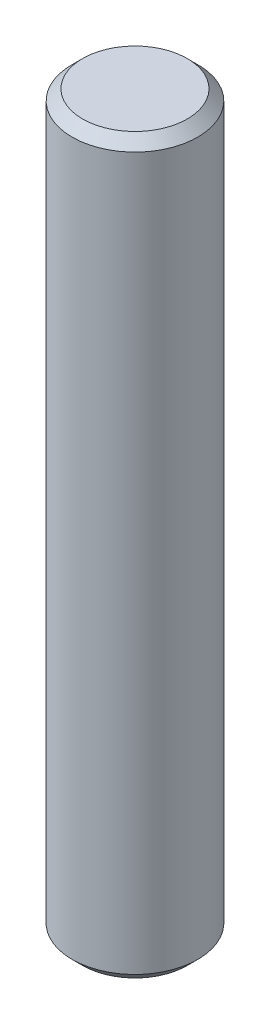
ISO-10303-21;
HEADER;
FILE_DESCRIPTION(('STEP AP214'),'2;1');
FILE_NAME('part.step','',(''),(''),'','','');
FILE_SCHEMA(('AUTOMOTIVE_DESIGN { 1 0 10303 214 1 1 1 1 }'));
ENDSEC;
DATA;
#1=APPLICATION_CONTEXT('core data for automotive mechanical design processes');
#2=APPLICATION_PROTOCOL_DEFINITION('international standard','automotive_design',2000,#1);
#3=PRODUCT_CONTEXT('',#1,'mechanical');
#4=PRODUCT('Part','Part','',(#3));
#5=PRODUCT_RELATED_PRODUCT_CATEGORY('part','',(#4));
#6=PRODUCT_DEFINITION_FORMATION('','',#4);
#7=PRODUCT_DEFINITION_CONTEXT('part definition',#1,'design');
#8=PRODUCT_DEFINITION('design','',#6,#7);
#9=PRODUCT_DEFINITION_SHAPE('','',#8);
#10=(LENGTH_UNIT() NAMED_UNIT(*) SI_UNIT(.MILLI.,.METRE.));
#11=(NAMED_UNIT(*) PLANE_ANGLE_UNIT() SI_UNIT($,.RADIAN.));
#12=(NAMED_UNIT(*) SI_UNIT($,.STERADIAN.) SOLID_ANGLE_UNIT());
#13=UNCERTAINTY_MEASURE_WITH_UNIT(LENGTH_MEASURE(1.E-05),#10,'distance_accuracy_value','');
#14=(GEOMETRIC_REPRESENTATION_CONTEXT(3) GLOBAL_UNCERTAINTY_ASSIGNED_CONTEXT((#13)) GLOBAL_UNIT_ASSIGNED_CONTEXT((#10,
#11,#12)) REPRESENTATION_CONTEXT('',''));
#15=CARTESIAN_POINT('',(0.,0.,0.));
#16=DIRECTION('',(0.,0.,1.));
#17=DIRECTION('',(1.,0.,0.));
#18=AXIS2_PLACEMENT_3D('',#15,#16,#17);
#19=CARTESIAN_POINT('',(0.,35.,0.));
#20=DIRECTION('',(0.,-1.,0.));
#21=DIRECTION('',(0.,0.,-1.));
#22=AXIS2_PLACEMENT_3D('',#19,#20,#21);
#23=CYLINDRICAL_SURFACE('',#22,3.);
#24=CARTESIAN_POINT('',(0.,0.5,0.));
#25=DIRECTION('',(0.,1.,0.));
#26=DIRECTION('',(0.,0.,1.));
#27=AXIS2_PLACEMENT_3D('',#24,#25,#26);
#28=CIRCLE('',#27,3.);
#29=CARTESIAN_POINT('',(0.,0.5,3.));
#30=VERTEX_POINT('',#29);
#31=EDGE_CURVE('E44',#30,#30,#28,.T.);
#32=ORIENTED_EDGE('',*,*,#31,.T.);
#33=EDGE_LOOP('',(#32));
#34=FACE_BOUND('',#33,.T.);
#35=CARTESIAN_POINT('',(0.,34.5,0.));
#36=DIRECTION('',(0.,1.,0.));
#37=DIRECTION('',(0.,0.,1.));
#38=AXIS2_PLACEMENT_3D('',#35,#36,#37);
#39=CIRCLE('',#38,3.);
#40=CARTESIAN_POINT('',(0.,34.5,3.));
#41=VERTEX_POINT('',#40);
#42=EDGE_CURVE('E48',#41,#41,#39,.F.);
#43=ORIENTED_EDGE('',*,*,#42,.T.);
#44=EDGE_LOOP('',(#43));
#45=FACE_BOUND('',#44,.T.);
#46=ADVANCED_FACE('F33',(#34,#45),#23,.T.);
#47=CARTESIAN_POINT('',(0.,35.,0.));
#48=DIRECTION('',(0.,1.,0.));
#49=DIRECTION('',(0.,0.,1.));
#50=AXIS2_PLACEMENT_3D('',#47,#48,#49);
#51=PLANE('',#50);
#52=CARTESIAN_POINT('',(0.,35.,0.));
#53=DIRECTION('',(0.,1.,0.));
#54=DIRECTION('',(0.,0.,1.));
#55=AXIS2_PLACEMENT_3D('',#52,#53,#54);
#56=CIRCLE('',#55,2.5);
#57=CARTESIAN_POINT('',(0.,35.,2.5));
#58=VERTEX_POINT('',#57);
#59=EDGE_CURVE('E10',#58,#58,#56,.T.);
#60=ORIENTED_EDGE('',*,*,#59,.T.);
#61=EDGE_LOOP('',(#60));
#62=FACE_BOUND('',#61,.T.);
#63=ADVANCED_FACE('F64',(#62),#51,.T.);
#64=CARTESIAN_POINT('',(0.,0.,0.));
#65=DIRECTION('',(0.,1.,0.));
#66=DIRECTION('',(0.,0.,1.));
#67=AXIS2_PLACEMENT_3D('',#64,#65,#66);
#68=PLANE('',#67);
#69=CARTESIAN_POINT('',(0.,0.,0.));
#70=DIRECTION('',(0.,1.,0.));
#71=DIRECTION('',(0.,0.,1.));
#72=AXIS2_PLACEMENT_3D('',#69,#70,#71);
#73=CIRCLE('',#72,2.5);
#74=CARTESIAN_POINT('',(0.,0.,2.5));
#75=VERTEX_POINT('',#74);
#76=EDGE_CURVE('E40',#75,#75,#73,.F.);
#77=ORIENTED_EDGE('',*,*,#76,.T.);
#78=EDGE_LOOP('',(#77));
#79=FACE_BOUND('',#78,.T.);
#80=ADVANCED_FACE('F61',(#79),#68,.F.);
#81=CARTESIAN_POINT('',(0.,0.5,0.));
#82=DIRECTION('',(0.,1.,0.));
#83=DIRECTION('',(0.,0.,1.));
#84=AXIS2_PLACEMENT_3D('',#81,#82,#83);
#85=CONICAL_SURFACE('',#84,3.,0.785398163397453);
#86=ORIENTED_EDGE('',*,*,#76,.F.);
#87=EDGE_LOOP('',(#86));
#88=FACE_BOUND('',#87,.T.);
#89=ORIENTED_EDGE('',*,*,#31,.F.);
#90=EDGE_LOOP('',(#89));
#91=FACE_BOUND('',#90,.T.);
#92=ADVANCED_FACE('F57',(#88,#91),#85,.T.);
#93=CARTESIAN_POINT('',(0.,35.,0.));
#94=DIRECTION('',(0.,-1.,0.));
#95=DIRECTION('',(0.,0.,-1.));
#96=AXIS2_PLACEMENT_3D('',#93,#94,#95);
#97=CONICAL_SURFACE('',#96,2.5,0.785398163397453);
#98=ORIENTED_EDGE('',*,*,#42,.F.);
#99=EDGE_LOOP('',(#98));
#100=FACE_BOUND('',#99,.T.);
#101=ORIENTED_EDGE('',*,*,#59,.F.);
#102=EDGE_LOOP('',(#101));
#103=FACE_BOUND('',#102,.T.);
#104=ADVANCED_FACE('F35',(#100,#103),#97,.T.);
#105=CLOSED_SHELL('',(#46,#63,#80,#92,#104));
#106=MANIFOLD_SOLID_BREP('B2',#105);
#107=ADVANCED_BREP_SHAPE_REPRESENTATION('',(#18,#106),#14);
#108=SHAPE_DEFINITION_REPRESENTATION(#9,#107);
ENDSEC;
END-ISO-10303-21;
